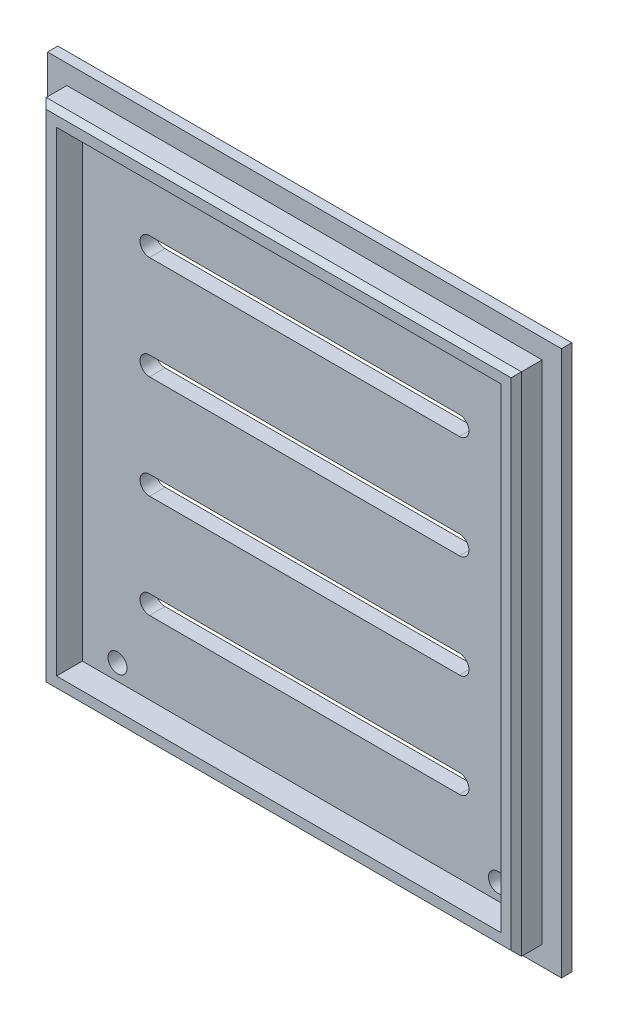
from build123d import *

# Parameters (mm, degrees)
SKETCH1_W              = 92
SKETCH1_H              = 98
SKETCH1_W_2            = 86
SKETCH1_H_2            = 92
LIP_DEPTH              = 5
SKETCH1_3_W            = 99.5
SKETCH1_3_H            = 105.5
SKETCH1_3_W_2          = 93.5
SKETCH1_3_H_2          = 99.5
SKETCH1_3_W_3          = 92
SKETCH1_3_H_3          = 98
SKETCH1_3_W_4          = 86
SKETCH1_3_H_4          = 92
BASE_DEPTH             = 3
BOLTS_REACH            = 151.091
SKETCH2_R              = 1.84
EXTERIOR_CHAMFERS_SIZE = 1
RAILS_REACH            = 150.961


with BuildPart() as part:
    # Sketch1 → Lip (new body)
    with BuildSketch(Plane(origin=(0, 0, -3480.092749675), x_dir=(-1, 0, 0), z_dir=(0, 0, -1))):
        with Locations((-2.25, -86.75)):
            Rectangle(SKETCH1_W, SKETCH1_H)
        with Locations((-2.25, -86.75)):
            Rectangle(SKETCH1_W_2, SKETCH1_H_2, mode=Mode.SUBTRACT)
    extrude(amount=-LIP_DEPTH)

    # Sketch1_3 → Base (add)
    # profile 1 of 4: a face of its own
    with BuildSketch(Plane(origin=(0, 0, -3480.092749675), x_dir=(-1, 0, 0), z_dir=(0, 0, -1))):
        with Locations((-2.25, -86.75)):
            Rectangle(SKETCH1_3_W, SKETCH1_3_H)
        with Locations((-2.25, -86.75)):
            Rectangle(SKETCH1_3_W_2, SKETCH1_3_H_2, mode=Mode.SUBTRACT)
    # profile 2 of 4: a face of its own
    with BuildSketch(Plane(origin=(0, 0, -3480.092749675), x_dir=(-1, 0, 0), z_dir=(0, 0, -1))):
        with Locations((-2.25, -86.75)):
            Rectangle(SKETCH1_3_W_2, SKETCH1_3_H_2)
        with Locations((-2.25, -86.75)):
            Rectangle(SKETCH1_3_W_3, SKETCH1_3_H_3, mode=Mode.SUBTRACT)
    # profile 3 of 4: a face of its own
    with BuildSketch(Plane(origin=(0, 0, -3480.092749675), x_dir=(-1, 0, 0), z_dir=(0, 0, -1))):
        with Locations((-2.25, -86.75)):
            Rectangle(SKETCH1_3_W_3, SKETCH1_3_H_3)
        with Locations((-2.25, -86.75)):
            Rectangle(SKETCH1_3_W_4, SKETCH1_3_H_4, mode=Mode.SUBTRACT)
    # profile 4 of 4: a face of its own
    with BuildSketch(Plane(origin=(0, 0, -3480.092749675), x_dir=(-1, 0, 0), z_dir=(0, 0, -1))):
        with Locations((-2.25, -86.75)):
            Rectangle(SKETCH1_3_W_4, SKETCH1_3_H_4)
    extrude(amount=BASE_DEPTH)

    # Sketch2 → Bolts (cut, up to next)
    with BuildSketch(Plane(origin=(0, 0, -3483.092749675), x_dir=(-1, 0, 0), z_dir=(0, 0, -1)), mode=Mode.PRIVATE) as bolts_sk1:
        with Locations((33.945, -129.615)):
            Circle(SKETCH2_R)
    bolts_tool1 = extrude(bolts_sk1.sketch, amount=-BOLTS_REACH, mode=Mode.PRIVATE) & part.part
    # Sketch2 → Bolts (cut, up to next)
    with BuildSketch(Plane(origin=(0, 0, -3483.092749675), x_dir=(-1, 0, 0), z_dir=(0, 0, -1)), mode=Mode.PRIVATE) as bolts_sk2:
        with Locations((-39.715, -129.615)):
            Circle(SKETCH2_R)
    bolts_tool2 = extrude(bolts_sk2.sketch, amount=-BOLTS_REACH, mode=Mode.PRIVATE) & part.part
    # Sketch2 → Bolts (cut, up to next)
    with BuildSketch(Plane(origin=(0, 0, -3483.092749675), x_dir=(-1, 0, 0), z_dir=(0, 0, -1)), mode=Mode.PRIVATE) as bolts_sk3:
        with Locations((-42.255, -43.885)):
            Circle(SKETCH2_R)
    bolts_tool3 = extrude(bolts_sk3.sketch, amount=-BOLTS_REACH, mode=Mode.PRIVATE) & part.part
    # Sketch2 → Bolts (cut, up to next)
    with BuildSketch(Plane(origin=(0, 0, -3483.092749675), x_dir=(-1, 0, 0), z_dir=(0, 0, -1)), mode=Mode.PRIVATE) as bolts_sk4:
        with Locations((37.755, -43.885)):
            Circle(SKETCH2_R)
    bolts_tool4 = extrude(bolts_sk4.sketch, amount=-BOLTS_REACH, mode=Mode.PRIVATE) & part.part
    add(bolts_tool1.solids().sort_by_distance((-33.945, -129.615, -3483.09275))[0], mode=Mode.SUBTRACT)
    add(bolts_tool2.solids().sort_by_distance((39.715, -129.615, -3483.09275))[0], mode=Mode.SUBTRACT)
    add(bolts_tool3.solids().sort_by_distance((42.255, -43.885, -3483.09275))[0], mode=Mode.SUBTRACT)
    add(bolts_tool4.solids().sort_by_distance((-37.755, -43.885, -3483.09275))[0], mode=Mode.SUBTRACT)

    # Exterior Chamfers
    exterior_chamfers_edges = [part.edges().sort_by_distance(p)[0] for p in [
        (48.25, -86.75, -3475.092749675),
        (2.25, -135.75, -3475.092749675),
        (-43.75, -86.75, -3475.092749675),
        (2.25, -139.5, -3483.092749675),
        (-47.5, -86.75, -3483.092749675),
        (2.25, -34, -3483.092749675),
        (52, -86.75, -3483.092749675),
        (2.25, -37.75, -3475.092749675),
    ]]
    chamfer(exterior_chamfers_edges, length=EXTERIOR_CHAMFERS_SIZE)

    # Sketch3 → Rails (cut, up to next)
    with BuildSketch(Plane.XY.offset(-3480.092749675), mode=Mode.PRIVATE) as rails_sk1:
        with BuildLine():
            Line((32.25, -54.91), (-27.75, -54.91))
            ThreePointArc((-27.75, -54.91), (-29.59, -56.75), (-27.75, -58.59))
            Line((-27.75, -58.59), (32.25, -58.59))
            ThreePointArc((32.25, -58.59), (34.09, -56.75), (32.25, -54.91))
        make_face()
    rails_tool1 = extrude(rails_sk1.sketch, amount=-RAILS_REACH, mode=Mode.PRIVATE) & part.part
    # Sketch3 → Rails (cut, up to next)
    with BuildSketch(Plane.XY.offset(-3480.092749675), mode=Mode.PRIVATE) as rails_sk2:
        with BuildLine():
            Line((32.25, -74.91), (-27.75, -74.91))
            ThreePointArc((-27.75, -74.91), (-29.59, -76.75), (-27.75, -78.59))
            Line((-27.75, -78.59), (32.25, -78.59))
            ThreePointArc((32.25, -78.59), (34.09, -76.75), (32.25, -74.91))
        make_face()
    rails_tool2 = extrude(rails_sk2.sketch, amount=-RAILS_REACH, mode=Mode.PRIVATE) & part.part
    # Sketch3 → Rails (cut, up to next)
    with BuildSketch(Plane.XY.offset(-3480.092749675), mode=Mode.PRIVATE) as rails_sk3:
        with BuildLine():
            Line((32.25, -94.91), (-27.75, -94.91))
            ThreePointArc((-27.75, -94.91), (-29.59, -96.75), (-27.75, -98.59))
            Line((-27.75, -98.59), (32.25, -98.59))
            ThreePointArc((32.25, -98.59), (34.09, -96.75), (32.25, -94.91))
        make_face()
    rails_tool3 = extrude(rails_sk3.sketch, amount=-RAILS_REACH, mode=Mode.PRIVATE) & part.part
    # Sketch3 → Rails (cut, up to next)
    with BuildSketch(Plane.XY.offset(-3480.092749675), mode=Mode.PRIVATE) as rails_sk4:
        with BuildLine():
            Line((-27.75, -114.91), (32.25, -114.91))
            ThreePointArc((32.25, -114.91), (34.09, -116.75), (32.25, -118.59))
            Line((32.25, -118.59), (-27.75, -118.59))
            ThreePointArc((-27.75, -118.59), (-29.59, -116.75), (-27.75, -114.91))
        make_face()
    rails_tool4 = extrude(rails_sk4.sketch, amount=-RAILS_REACH, mode=Mode.PRIVATE) & part.part
    add(rails_tool1.solids().sort_by_distance((2.25, -56.75, -3480.09275))[0], mode=Mode.SUBTRACT)
    add(rails_tool2.solids().sort_by_distance((2.25, -76.75, -3480.09275))[0], mode=Mode.SUBTRACT)
    add(rails_tool3.solids().sort_by_distance((2.25, -96.75, -3480.09275))[0], mode=Mode.SUBTRACT)
    add(rails_tool4.solids().sort_by_distance((2.25, -116.75, -3480.09275))[0], mode=Mode.SUBTRACT)


solid = part.part
